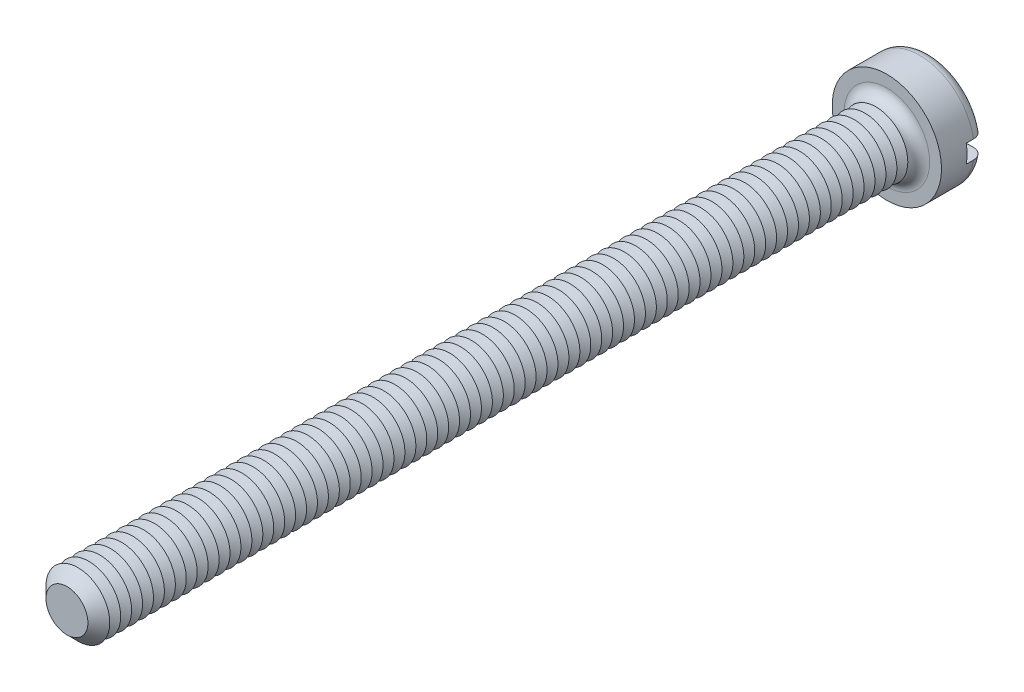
from build123d import *

# Parameters (mm, degrees)
SKETCH3_R           = 3
BOSS_EXTRUDE2_DEPTH = 2.4
SKETCH4_R           = 1.75
BOSS_EXTRUDE3_DEPTH = 45
FILLET1_R           = 0.6
CHAMFER1_SIZE       = 0.6
LPATTERN1_COUNT     = 73
LPATTERN1_PITCH     = 0.6
SKETCH8_W           = 6
SKETCH8_H           = 1
CUT_EXTRUDE1_DEPTH  = 1


with BuildPart() as part:
    # Sketch3 → Boss-Extrude2 (new body)
    with BuildSketch(Plane.XY):
        Circle(SKETCH3_R)
    extrude(amount=-BOSS_EXTRUDE2_DEPTH)

    # Sketch4 → Boss-Extrude3 (add)
    with BuildSketch(Plane.XY):
        with Locations(Location((0, 0, 0), (0, 0, 180))):
            Circle(SKETCH4_R)
    extrude(amount=BOSS_EXTRUDE3_DEPTH)

    # Fillet1
    fillet1_edges = [part.edges().sort_by_distance(p)[0] for p in [
        (-3, 0, -2.4),
        (1.75, 0, 0),
    ]]
    fillet(fillet1_edges, radius=FILLET1_R)

    # Chamfer1
    chamfer1_edges = [part.edges().sort_by_distance(p)[0] for p in [
        (1.75, 0, 45),
    ]]
    chamfer(chamfer1_edges, length=CHAMFER1_SIZE)

    # Sketch6 → Cut-Revolve1 (revolve, cut)
    with BuildSketch(Plane(origin=(0, 0, 0), x_dir=(0, 0, -1), z_dir=(1, 0, 0)), mode=Mode.PRIVATE) as cut_revolve1_sk:
        Polygon((-0.6, 1.75), (-0.9, 1.230384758), (-1.2, 1.75), align=None)
    cut_revolve1 = revolve(cut_revolve1_sk.sketch.rotate(Axis((0, 0, -1.694361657), (0, 0, 1)), 90), axis=Axis((0, 0, -1.694361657), (0, 0, 1)), mode=Mode.SUBTRACT)

    # LPattern1: Cut-Revolve1 ×73
    with Locations(*[(0, 0, i * LPATTERN1_PITCH) for i in range(1, LPATTERN1_COUNT)]):
        add(cut_revolve1, mode=Mode.SUBTRACT)

    # Sketch8 → Cut-Extrude1 (cut)
    with BuildSketch(Plane(origin=(0, 0, -2.4), x_dir=(-1, 0, 0), z_dir=(0, 0, -1))):
        Rectangle(SKETCH8_W, SKETCH8_H)
    extrude(amount=-CUT_EXTRUDE1_DEPTH, mode=Mode.SUBTRACT)


solid = part.part
